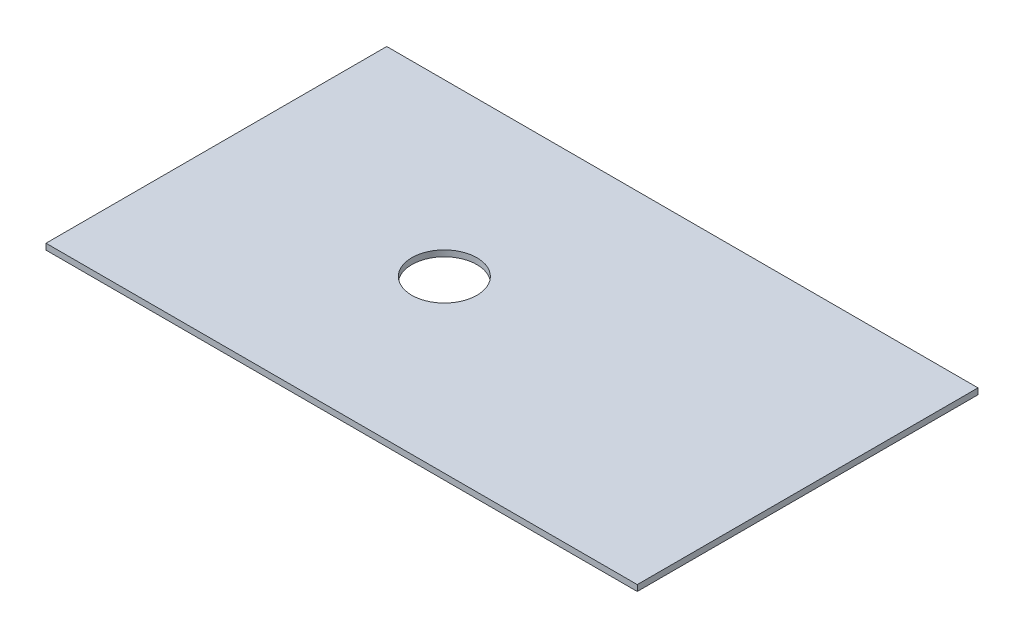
ISO-10303-21;
HEADER;
FILE_DESCRIPTION(('STEP AP214'),'2;1');
FILE_NAME('part.step','',(''),(''),'','','');
FILE_SCHEMA(('AUTOMOTIVE_DESIGN { 1 0 10303 214 1 1 1 1 }'));
ENDSEC;
DATA;
#1=APPLICATION_CONTEXT('core data for automotive mechanical design processes');
#2=APPLICATION_PROTOCOL_DEFINITION('international standard','automotive_design',2000,#1);
#3=PRODUCT_CONTEXT('',#1,'mechanical');
#4=PRODUCT('Part','Part','',(#3));
#5=PRODUCT_RELATED_PRODUCT_CATEGORY('part','',(#4));
#6=PRODUCT_DEFINITION_FORMATION('','',#4);
#7=PRODUCT_DEFINITION_CONTEXT('part definition',#1,'design');
#8=PRODUCT_DEFINITION('design','',#6,#7);
#9=PRODUCT_DEFINITION_SHAPE('','',#8);
#10=(LENGTH_UNIT() NAMED_UNIT(*) SI_UNIT(.MILLI.,.METRE.));
#11=(NAMED_UNIT(*) PLANE_ANGLE_UNIT() SI_UNIT($,.RADIAN.));
#12=(NAMED_UNIT(*) SI_UNIT($,.STERADIAN.) SOLID_ANGLE_UNIT());
#13=UNCERTAINTY_MEASURE_WITH_UNIT(LENGTH_MEASURE(1.E-05),#10,'distance_accuracy_value','');
#14=(GEOMETRIC_REPRESENTATION_CONTEXT(3) GLOBAL_UNCERTAINTY_ASSIGNED_CONTEXT((#13)) GLOBAL_UNIT_ASSIGNED_CONTEXT((#10,
#11,#12)) REPRESENTATION_CONTEXT('',''));
#15=CARTESIAN_POINT('',(0.,0.,0.));
#16=DIRECTION('',(0.,0.,1.));
#17=DIRECTION('',(1.,0.,0.));
#18=AXIS2_PLACEMENT_3D('',#15,#16,#17);
#19=CARTESIAN_POINT('',(590.,6.,340.));
#20=DIRECTION('',(-1.,0.,0.));
#21=DIRECTION('',(0.,0.,1.));
#22=AXIS2_PLACEMENT_3D('',#19,#20,#21);
#23=PLANE('',#22);
#24=DIRECTION('',(0.,0.,-1.));
#25=VECTOR('',#24,1.);
#26=CARTESIAN_POINT('',(590.,-6.,340.));
#27=LINE('',#26,#25);
#28=CARTESIAN_POINT('',(590.,-6.,340.));
#29=VERTEX_POINT('',#28);
#30=CARTESIAN_POINT('',(590.,-6.,-340.));
#31=VERTEX_POINT('',#30);
#32=EDGE_CURVE('E99',#29,#31,#27,.T.);
#33=ORIENTED_EDGE('',*,*,#32,.T.);
#34=DIRECTION('',(0.,-1.,0.));
#35=VECTOR('',#34,1.);
#36=CARTESIAN_POINT('',(590.,6.,-340.));
#37=LINE('',#36,#35);
#38=CARTESIAN_POINT('',(590.,6.,-340.));
#39=VERTEX_POINT('',#38);
#40=EDGE_CURVE('E11',#39,#31,#37,.T.);
#41=ORIENTED_EDGE('',*,*,#40,.F.);
#42=DIRECTION('',(0.,0.,-1.));
#43=VECTOR('',#42,1.);
#44=CARTESIAN_POINT('',(590.,6.,340.));
#45=LINE('',#44,#43);
#46=CARTESIAN_POINT('',(590.,6.,340.));
#47=VERTEX_POINT('',#46);
#48=EDGE_CURVE('E87',#47,#39,#45,.T.);
#49=ORIENTED_EDGE('',*,*,#48,.F.);
#50=DIRECTION('',(0.,-1.,0.));
#51=VECTOR('',#50,1.);
#52=CARTESIAN_POINT('',(590.,6.,340.));
#53=LINE('',#52,#51);
#54=EDGE_CURVE('E95',#47,#29,#53,.T.);
#55=ORIENTED_EDGE('',*,*,#54,.T.);
#56=EDGE_LOOP('',(#33,#41,#49,#55));
#57=FACE_BOUND('',#56,.T.);
#58=ADVANCED_FACE('F36',(#57),#23,.F.);
#59=CARTESIAN_POINT('',(-590.,6.,-340.));
#60=DIRECTION('',(0.,0.,1.));
#61=DIRECTION('',(1.,0.,0.));
#62=AXIS2_PLACEMENT_3D('',#59,#60,#61);
#63=PLANE('',#62);
#64=DIRECTION('',(-1.,0.,0.));
#65=VECTOR('',#64,1.);
#66=CARTESIAN_POINT('',(-590.,-6.,-340.));
#67=LINE('',#66,#65);
#68=CARTESIAN_POINT('',(-590.,-6.,-340.));
#69=VERTEX_POINT('',#68);
#70=EDGE_CURVE('E91',#31,#69,#67,.T.);
#71=ORIENTED_EDGE('',*,*,#70,.T.);
#72=DIRECTION('',(0.,-1.,0.));
#73=VECTOR('',#72,1.);
#74=CARTESIAN_POINT('',(-590.,6.,-340.));
#75=LINE('',#74,#73);
#76=CARTESIAN_POINT('',(-590.,6.,-340.));
#77=VERTEX_POINT('',#76);
#78=EDGE_CURVE('E44',#77,#69,#75,.T.);
#79=ORIENTED_EDGE('',*,*,#78,.F.);
#80=DIRECTION('',(-1.,0.,0.));
#81=VECTOR('',#80,1.);
#82=CARTESIAN_POINT('',(-590.,6.,-340.));
#83=LINE('',#82,#81);
#84=EDGE_CURVE('E82',#39,#77,#83,.T.);
#85=ORIENTED_EDGE('',*,*,#84,.F.);
#86=ORIENTED_EDGE('',*,*,#40,.T.);
#87=EDGE_LOOP('',(#71,#79,#85,#86));
#88=FACE_BOUND('',#87,.T.);
#89=ADVANCED_FACE('F90',(#88),#63,.F.);
#90=CARTESIAN_POINT('',(-590.,6.,340.));
#91=DIRECTION('',(1.,0.,0.));
#92=DIRECTION('',(0.,0.,-1.));
#93=AXIS2_PLACEMENT_3D('',#90,#91,#92);
#94=PLANE('',#93);
#95=DIRECTION('',(0.,0.,1.));
#96=VECTOR('',#95,1.);
#97=CARTESIAN_POINT('',(-590.,-6.,340.));
#98=LINE('',#97,#96);
#99=CARTESIAN_POINT('',(-590.,-6.,340.));
#100=VERTEX_POINT('',#99);
#101=EDGE_CURVE('E69',#69,#100,#98,.T.);
#102=ORIENTED_EDGE('',*,*,#101,.T.);
#103=DIRECTION('',(0.,-1.,0.));
#104=VECTOR('',#103,1.);
#105=CARTESIAN_POINT('',(-590.,6.,340.));
#106=LINE('',#105,#104);
#107=CARTESIAN_POINT('',(-590.,6.,340.));
#108=VERTEX_POINT('',#107);
#109=EDGE_CURVE('E92',#108,#100,#106,.T.);
#110=ORIENTED_EDGE('',*,*,#109,.F.);
#111=DIRECTION('',(0.,0.,1.));
#112=VECTOR('',#111,1.);
#113=CARTESIAN_POINT('',(-590.,6.,340.));
#114=LINE('',#113,#112);
#115=EDGE_CURVE('E85',#77,#108,#114,.T.);
#116=ORIENTED_EDGE('',*,*,#115,.F.);
#117=ORIENTED_EDGE('',*,*,#78,.T.);
#118=EDGE_LOOP('',(#102,#110,#116,#117));
#119=FACE_BOUND('',#118,.T.);
#120=ADVANCED_FACE('F93',(#119),#94,.F.);
#121=CARTESIAN_POINT('',(-590.,6.,340.));
#122=DIRECTION('',(0.,0.,-1.));
#123=DIRECTION('',(-1.,0.,0.));
#124=AXIS2_PLACEMENT_3D('',#121,#122,#123);
#125=PLANE('',#124);
#126=DIRECTION('',(1.,0.,0.));
#127=VECTOR('',#126,1.);
#128=CARTESIAN_POINT('',(-590.,-6.,340.));
#129=LINE('',#128,#127);
#130=EDGE_CURVE('E75',#100,#29,#129,.T.);
#131=ORIENTED_EDGE('',*,*,#130,.T.);
#132=ORIENTED_EDGE('',*,*,#54,.F.);
#133=DIRECTION('',(1.,0.,0.));
#134=VECTOR('',#133,1.);
#135=CARTESIAN_POINT('',(-590.,6.,340.));
#136=LINE('',#135,#134);
#137=EDGE_CURVE('E52',#108,#47,#136,.T.);
#138=ORIENTED_EDGE('',*,*,#137,.F.);
#139=ORIENTED_EDGE('',*,*,#109,.T.);
#140=EDGE_LOOP('',(#131,#132,#138,#139));
#141=FACE_BOUND('',#140,.T.);
#142=ADVANCED_FACE('F107',(#141),#125,.F.);
#143=CARTESIAN_POINT('',(0.,6.,0.));
#144=DIRECTION('',(0.,-1.,0.));
#145=DIRECTION('',(0.,0.,-1.));
#146=AXIS2_PLACEMENT_3D('',#143,#144,#145);
#147=PLANE('',#146);
#148=CARTESIAN_POINT('',(-135.,6.,-3.43561984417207E-12));
#149=DIRECTION('',(0.,1.,0.));
#150=DIRECTION('',(0.,0.,1.));
#151=AXIS2_PLACEMENT_3D('',#148,#149,#150);
#152=CIRCLE('',#151,65.);
#153=CARTESIAN_POINT('',(-135.,6.,64.9999999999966));
#154=VERTEX_POINT('',#153);
#155=EDGE_CURVE('E102',#154,#154,#152,.T.);
#156=ORIENTED_EDGE('',*,*,#155,.F.);
#157=EDGE_LOOP('',(#156));
#158=FACE_BOUND('',#157,.T.);
#159=ORIENTED_EDGE('',*,*,#48,.T.);
#160=ORIENTED_EDGE('',*,*,#84,.T.);
#161=ORIENTED_EDGE('',*,*,#115,.T.);
#162=ORIENTED_EDGE('',*,*,#137,.T.);
#163=EDGE_LOOP('',(#159,#160,#161,#162));
#164=FACE_BOUND('',#163,.T.);
#165=ADVANCED_FACE('F83',(#158,#164),#147,.F.);
#166=CARTESIAN_POINT('',(0.,-6.,0.));
#167=DIRECTION('',(0.,-1.,0.));
#168=DIRECTION('',(0.,0.,-1.));
#169=AXIS2_PLACEMENT_3D('',#166,#167,#168);
#170=PLANE('',#169);
#171=CARTESIAN_POINT('',(-135.,-6.,-3.43561984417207E-12));
#172=DIRECTION('',(0.,-1.,0.));
#173=DIRECTION('',(0.,0.,-1.));
#174=AXIS2_PLACEMENT_3D('',#171,#172,#173);
#175=CIRCLE('',#174,65.);
#176=CARTESIAN_POINT('',(-135.,-6.,-65.0000000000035));
#177=VERTEX_POINT('',#176);
#178=EDGE_CURVE('E113',#177,#177,#175,.F.);
#179=ORIENTED_EDGE('',*,*,#178,.T.);
#180=EDGE_LOOP('',(#179));
#181=FACE_BOUND('',#180,.T.);
#182=ORIENTED_EDGE('',*,*,#32,.F.);
#183=ORIENTED_EDGE('',*,*,#130,.F.);
#184=ORIENTED_EDGE('',*,*,#101,.F.);
#185=ORIENTED_EDGE('',*,*,#70,.F.);
#186=EDGE_LOOP('',(#182,#183,#184,#185));
#187=FACE_BOUND('',#186,.T.);
#188=ADVANCED_FACE('F110',(#181,#187),#170,.T.);
#189=CARTESIAN_POINT('',(-135.,-6.001,-3.43561984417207E-12));
#190=DIRECTION('',(0.,1.,0.));
#191=DIRECTION('',(0.,0.,1.));
#192=AXIS2_PLACEMENT_3D('',#189,#190,#191);
#193=CYLINDRICAL_SURFACE('',#192,65.);
#194=ORIENTED_EDGE('',*,*,#178,.F.);
#195=EDGE_LOOP('',(#194));
#196=FACE_BOUND('',#195,.T.);
#197=ORIENTED_EDGE('',*,*,#155,.T.);
#198=EDGE_LOOP('',(#197));
#199=FACE_BOUND('',#198,.T.);
#200=ADVANCED_FACE('F119',(#196,#199),#193,.F.);
#201=CLOSED_SHELL('',(#58,#89,#120,#142,#165,#188,#200));
#202=MANIFOLD_SOLID_BREP('B2',#201);
#203=ADVANCED_BREP_SHAPE_REPRESENTATION('',(#18,#202),#14);
#204=SHAPE_DEFINITION_REPRESENTATION(#9,#203);
ENDSEC;
END-ISO-10303-21;
